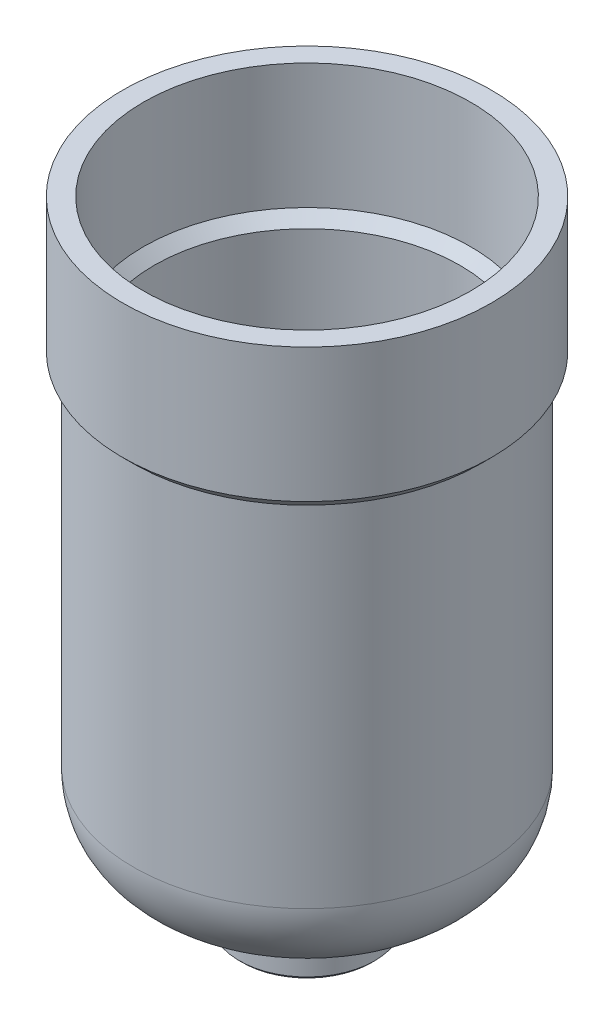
ISO-10303-21;
HEADER;
FILE_DESCRIPTION(('STEP AP214'),'2;1');
FILE_NAME('part.step','',(''),(''),'','','');
FILE_SCHEMA(('AUTOMOTIVE_DESIGN { 1 0 10303 214 1 1 1 1 }'));
ENDSEC;
DATA;
#1=APPLICATION_CONTEXT('core data for automotive mechanical design processes');
#2=APPLICATION_PROTOCOL_DEFINITION('international standard','automotive_design',2000,#1);
#3=PRODUCT_CONTEXT('',#1,'mechanical');
#4=PRODUCT('Part','Part','',(#3));
#5=PRODUCT_RELATED_PRODUCT_CATEGORY('part','',(#4));
#6=PRODUCT_DEFINITION_FORMATION('','',#4);
#7=PRODUCT_DEFINITION_CONTEXT('part definition',#1,'design');
#8=PRODUCT_DEFINITION('design','',#6,#7);
#9=PRODUCT_DEFINITION_SHAPE('','',#8);
#10=(LENGTH_UNIT() NAMED_UNIT(*) SI_UNIT(.MILLI.,.METRE.));
#11=(NAMED_UNIT(*) PLANE_ANGLE_UNIT() SI_UNIT($,.RADIAN.));
#12=(NAMED_UNIT(*) SI_UNIT($,.STERADIAN.) SOLID_ANGLE_UNIT());
#13=UNCERTAINTY_MEASURE_WITH_UNIT(LENGTH_MEASURE(1.E-05),#10,'distance_accuracy_value','');
#14=(GEOMETRIC_REPRESENTATION_CONTEXT(3) GLOBAL_UNCERTAINTY_ASSIGNED_CONTEXT((#13)) GLOBAL_UNIT_ASSIGNED_CONTEXT((#10,
#11,#12)) REPRESENTATION_CONTEXT('',''));
#15=CARTESIAN_POINT('',(0.,0.,0.));
#16=DIRECTION('',(0.,0.,1.));
#17=DIRECTION('',(1.,0.,0.));
#18=AXIS2_PLACEMENT_3D('',#15,#16,#17);
#19=CARTESIAN_POINT('',(-6.7,-53.5,0.));
#20=DIRECTION('',(0.,-1.,0.));
#21=DIRECTION('',(1.,0.,0.));
#22=AXIS2_PLACEMENT_3D('',#19,#20,#21);
#23=PLANE('',#22);
#24=CARTESIAN_POINT('',(0.,-53.5,0.));
#25=DIRECTION('',(0.,-1.,0.));
#26=DIRECTION('',(1.,0.,0.));
#27=AXIS2_PLACEMENT_3D('',#24,#25,#26);
#28=CIRCLE('',#27,6.7);
#29=CARTESIAN_POINT('',(6.7,-53.5,0.));
#30=VERTEX_POINT('',#29);
#31=EDGE_CURVE('E10',#30,#30,#28,.T.);
#32=ORIENTED_EDGE('',*,*,#31,.F.);
#33=EDGE_LOOP('',(#32));
#34=FACE_BOUND('',#33,.T.);
#35=ADVANCED_FACE('F33',(#34),#23,.F.);
#36=CARTESIAN_POINT('',(0.,-45.5,0.));
#37=DIRECTION('',(0.,-1.,0.));
#38=DIRECTION('',(1.,0.,0.));
#39=AXIS2_PLACEMENT_3D('',#36,#37,#38);
#40=DEGENERATE_TOROIDAL_SURFACE('',#39,6.70000000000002,7.99999999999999,.T.);
#41=CARTESIAN_POINT('',(0.,-45.5,0.));
#42=DIRECTION('',(0.,-1.,0.));
#43=DIRECTION('',(1.,0.,0.));
#44=AXIS2_PLACEMENT_3D('',#41,#42,#43);
#45=CIRCLE('',#44,14.7);
#46=CARTESIAN_POINT('',(14.7,-45.5,0.));
#47=VERTEX_POINT('',#46);
#48=EDGE_CURVE('E39',#47,#47,#45,.T.);
#49=ORIENTED_EDGE('',*,*,#48,.F.);
#50=EDGE_LOOP('',(#49));
#51=FACE_BOUND('',#50,.T.);
#52=ORIENTED_EDGE('',*,*,#31,.T.);
#53=EDGE_LOOP('',(#52));
#54=FACE_BOUND('',#53,.T.);
#55=ADVANCED_FACE('F153',(#51,#54),#40,.F.);
#56=CARTESIAN_POINT('',(0.,0.,0.));
#57=DIRECTION('',(0.,-1.,0.));
#58=DIRECTION('',(1.,0.,0.));
#59=AXIS2_PLACEMENT_3D('',#56,#57,#58);
#60=CYLINDRICAL_SURFACE('',#59,14.7);
#61=CARTESIAN_POINT('',(0.,-13.0715728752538,0.));
#62=DIRECTION('',(0.,-1.,0.));
#63=DIRECTION('',(1.,0.,0.));
#64=AXIS2_PLACEMENT_3D('',#61,#62,#63);
#65=CIRCLE('',#64,14.7);
#66=CARTESIAN_POINT('',(14.7,-13.0715728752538,0.));
#67=VERTEX_POINT('',#66);
#68=EDGE_CURVE('E43',#67,#67,#65,.T.);
#69=ORIENTED_EDGE('',*,*,#68,.F.);
#70=EDGE_LOOP('',(#69));
#71=FACE_BOUND('',#70,.T.);
#72=ORIENTED_EDGE('',*,*,#48,.T.);
#73=EDGE_LOOP('',(#72));
#74=FACE_BOUND('',#73,.T.);
#75=ADVANCED_FACE('F148',(#71,#74),#60,.F.);
#76=CARTESIAN_POINT('',(0.,-13.0715728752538,0.));
#77=DIRECTION('',(0.,1.,0.));
#78=DIRECTION('',(-1.,0.,0.));
#79=AXIS2_PLACEMENT_3D('',#76,#77,#78);
#80=CONICAL_SURFACE('',#79,14.7,0.78539816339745);
#81=CARTESIAN_POINT('',(0.,-12.0390728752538,0.));
#82=DIRECTION('',(0.,-1.,0.));
#83=DIRECTION('',(1.,0.,0.));
#84=AXIS2_PLACEMENT_3D('',#81,#82,#83);
#85=CIRCLE('',#84,15.7325);
#86=CARTESIAN_POINT('',(15.7325,-12.0390728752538,0.));
#87=VERTEX_POINT('',#86);
#88=EDGE_CURVE('E47',#87,#87,#85,.T.);
#89=ORIENTED_EDGE('',*,*,#88,.F.);
#90=EDGE_LOOP('',(#89));
#91=FACE_BOUND('',#90,.T.);
#92=ORIENTED_EDGE('',*,*,#68,.T.);
#93=EDGE_LOOP('',(#92));
#94=FACE_BOUND('',#93,.T.);
#95=ADVANCED_FACE('F142',(#91,#94),#80,.F.);
#96=CARTESIAN_POINT('',(0.,0.,0.));
#97=DIRECTION('',(0.,-1.,0.));
#98=DIRECTION('',(1.,0.,0.));
#99=AXIS2_PLACEMENT_3D('',#96,#97,#98);
#100=CYLINDRICAL_SURFACE('',#99,15.7325);
#101=CARTESIAN_POINT('',(0.,0.,0.));
#102=DIRECTION('',(0.,-1.,0.));
#103=DIRECTION('',(1.,0.,0.));
#104=AXIS2_PLACEMENT_3D('',#101,#102,#103);
#105=CIRCLE('',#104,15.7325);
#106=CARTESIAN_POINT('',(15.7325,0.,0.));
#107=VERTEX_POINT('',#106);
#108=EDGE_CURVE('E52',#107,#107,#105,.T.);
#109=ORIENTED_EDGE('',*,*,#108,.F.);
#110=EDGE_LOOP('',(#109));
#111=FACE_BOUND('',#110,.T.);
#112=ORIENTED_EDGE('',*,*,#88,.T.);
#113=EDGE_LOOP('',(#112));
#114=FACE_BOUND('',#113,.T.);
#115=ADVANCED_FACE('F136',(#111,#114),#100,.F.);
#116=CARTESIAN_POINT('',(-17.7325,0.,0.));
#117=DIRECTION('',(0.,-1.,0.));
#118=DIRECTION('',(1.,0.,0.));
#119=AXIS2_PLACEMENT_3D('',#116,#117,#118);
#120=PLANE('',#119);
#121=CARTESIAN_POINT('',(0.,0.,0.));
#122=DIRECTION('',(0.,-1.,0.));
#123=DIRECTION('',(1.,0.,0.));
#124=AXIS2_PLACEMENT_3D('',#121,#122,#123);
#125=CIRCLE('',#124,17.7325);
#126=CARTESIAN_POINT('',(17.7325,0.,0.));
#127=VERTEX_POINT('',#126);
#128=EDGE_CURVE('E55',#127,#127,#125,.T.);
#129=ORIENTED_EDGE('',*,*,#128,.F.);
#130=EDGE_LOOP('',(#129));
#131=FACE_BOUND('',#130,.T.);
#132=ORIENTED_EDGE('',*,*,#108,.T.);
#133=EDGE_LOOP('',(#132));
#134=FACE_BOUND('',#133,.T.);
#135=ADVANCED_FACE('F130',(#131,#134),#120,.F.);
#136=CARTESIAN_POINT('',(0.,0.,0.));
#137=DIRECTION('',(0.,-1.,0.));
#138=DIRECTION('',(1.,0.,0.));
#139=AXIS2_PLACEMENT_3D('',#136,#137,#138);
#140=CYLINDRICAL_SURFACE('',#139,17.7325);
#141=CARTESIAN_POINT('',(0.,-12.8675,0.));
#142=DIRECTION('',(0.,-1.,0.));
#143=DIRECTION('',(1.,0.,0.));
#144=AXIS2_PLACEMENT_3D('',#141,#142,#143);
#145=CIRCLE('',#144,17.7325);
#146=CARTESIAN_POINT('',(17.7325,-12.8675,0.));
#147=VERTEX_POINT('',#146);
#148=EDGE_CURVE('E58',#147,#147,#145,.T.);
#149=ORIENTED_EDGE('',*,*,#148,.F.);
#150=EDGE_LOOP('',(#149));
#151=FACE_BOUND('',#150,.T.);
#152=ORIENTED_EDGE('',*,*,#128,.T.);
#153=EDGE_LOOP('',(#152));
#154=FACE_BOUND('',#153,.T.);
#155=ADVANCED_FACE('F124',(#151,#154),#140,.T.);
#156=CARTESIAN_POINT('',(0.,-12.8675,0.));
#157=DIRECTION('',(0.,1.,0.));
#158=DIRECTION('',(-1.,0.,0.));
#159=AXIS2_PLACEMENT_3D('',#156,#157,#158);
#160=CONICAL_SURFACE('',#159,17.7325,0.78539816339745);
#161=CARTESIAN_POINT('',(0.,-13.9,0.));
#162=DIRECTION('',(0.,-1.,0.));
#163=DIRECTION('',(1.,0.,0.));
#164=AXIS2_PLACEMENT_3D('',#161,#162,#163);
#165=CIRCLE('',#164,16.7);
#166=CARTESIAN_POINT('',(16.7,-13.9,0.));
#167=VERTEX_POINT('',#166);
#168=EDGE_CURVE('E61',#167,#167,#165,.T.);
#169=ORIENTED_EDGE('',*,*,#168,.F.);
#170=EDGE_LOOP('',(#169));
#171=FACE_BOUND('',#170,.T.);
#172=ORIENTED_EDGE('',*,*,#148,.T.);
#173=EDGE_LOOP('',(#172));
#174=FACE_BOUND('',#173,.T.);
#175=ADVANCED_FACE('F118',(#171,#174),#160,.T.);
#176=CARTESIAN_POINT('',(0.,0.,0.));
#177=DIRECTION('',(0.,-1.,0.));
#178=DIRECTION('',(1.,0.,0.));
#179=AXIS2_PLACEMENT_3D('',#176,#177,#178);
#180=CYLINDRICAL_SURFACE('',#179,16.7);
#181=CARTESIAN_POINT('',(0.,-47.5,0.));
#182=DIRECTION('',(0.,-1.,0.));
#183=DIRECTION('',(1.,0.,0.));
#184=AXIS2_PLACEMENT_3D('',#181,#182,#183);
#185=CIRCLE('',#184,16.7);
#186=CARTESIAN_POINT('',(16.7,-47.5,0.));
#187=VERTEX_POINT('',#186);
#188=EDGE_CURVE('E64',#187,#187,#185,.T.);
#189=ORIENTED_EDGE('',*,*,#188,.F.);
#190=EDGE_LOOP('',(#189));
#191=FACE_BOUND('',#190,.T.);
#192=ORIENTED_EDGE('',*,*,#168,.T.);
#193=EDGE_LOOP('',(#192));
#194=FACE_BOUND('',#193,.T.);
#195=ADVANCED_FACE('F112',(#191,#194),#180,.T.);
#196=CARTESIAN_POINT('',(0.,-47.5,0.));
#197=DIRECTION('',(0.,-1.,0.));
#198=DIRECTION('',(1.,0.,0.));
#199=AXIS2_PLACEMENT_3D('',#196,#197,#198);
#200=TOROIDAL_SURFACE('',#199,8.7,7.99999999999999);
#201=CARTESIAN_POINT('',(0.,-55.5,0.));
#202=DIRECTION('',(0.,-1.,0.));
#203=DIRECTION('',(1.,0.,0.));
#204=AXIS2_PLACEMENT_3D('',#201,#202,#203);
#205=CIRCLE('',#204,8.7);
#206=CARTESIAN_POINT('',(8.7,-55.5,0.));
#207=VERTEX_POINT('',#206);
#208=EDGE_CURVE('E67',#207,#207,#205,.T.);
#209=ORIENTED_EDGE('',*,*,#208,.F.);
#210=EDGE_LOOP('',(#209));
#211=FACE_BOUND('',#210,.T.);
#212=ORIENTED_EDGE('',*,*,#188,.T.);
#213=EDGE_LOOP('',(#212));
#214=FACE_BOUND('',#213,.T.);
#215=ADVANCED_FACE('F106',(#211,#214),#200,.T.);
#216=CARTESIAN_POINT('',(-7.5,-55.5,0.));
#217=DIRECTION('',(0.,1.,0.));
#218=DIRECTION('',(-1.,0.,0.));
#219=AXIS2_PLACEMENT_3D('',#216,#217,#218);
#220=PLANE('',#219);
#221=CARTESIAN_POINT('',(0.,-55.5,0.));
#222=DIRECTION('',(0.,-1.,0.));
#223=DIRECTION('',(1.,0.,0.));
#224=AXIS2_PLACEMENT_3D('',#221,#222,#223);
#225=CIRCLE('',#224,7.5);
#226=CARTESIAN_POINT('',(7.5,-55.5,0.));
#227=VERTEX_POINT('',#226);
#228=EDGE_CURVE('E70',#227,#227,#225,.T.);
#229=ORIENTED_EDGE('',*,*,#228,.F.);
#230=EDGE_LOOP('',(#229));
#231=FACE_BOUND('',#230,.T.);
#232=ORIENTED_EDGE('',*,*,#208,.T.);
#233=EDGE_LOOP('',(#232));
#234=FACE_BOUND('',#233,.T.);
#235=ADVANCED_FACE('F100',(#231,#234),#220,.F.);
#236=CARTESIAN_POINT('',(0.,-56.5,0.));
#237=DIRECTION('',(0.,-1.,0.));
#238=DIRECTION('',(1.,0.,0.));
#239=AXIS2_PLACEMENT_3D('',#236,#237,#238);
#240=TOROIDAL_SURFACE('',#239,7.50000000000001,1.);
#241=CARTESIAN_POINT('',(0.,-56.5,0.));
#242=DIRECTION('',(0.,-1.,0.));
#243=DIRECTION('',(1.,0.,0.));
#244=AXIS2_PLACEMENT_3D('',#241,#242,#243);
#245=CIRCLE('',#244,6.5);
#246=CARTESIAN_POINT('',(6.5,-56.5,0.));
#247=VERTEX_POINT('',#246);
#248=EDGE_CURVE('E73',#247,#247,#245,.T.);
#249=ORIENTED_EDGE('',*,*,#248,.F.);
#250=EDGE_LOOP('',(#249));
#251=FACE_BOUND('',#250,.T.);
#252=ORIENTED_EDGE('',*,*,#228,.T.);
#253=EDGE_LOOP('',(#252));
#254=FACE_BOUND('',#253,.T.);
#255=ADVANCED_FACE('F94',(#251,#254),#240,.F.);
#256=CARTESIAN_POINT('',(0.,0.,0.));
#257=DIRECTION('',(0.,-1.,0.));
#258=DIRECTION('',(1.,0.,0.));
#259=AXIS2_PLACEMENT_3D('',#256,#257,#258);
#260=CYLINDRICAL_SURFACE('',#259,6.5);
#261=CARTESIAN_POINT('',(0.,-60.4,0.));
#262=DIRECTION('',(0.,-1.,0.));
#263=DIRECTION('',(1.,0.,0.));
#264=AXIS2_PLACEMENT_3D('',#261,#262,#263);
#265=CIRCLE('',#264,6.5);
#266=CARTESIAN_POINT('',(6.5,-60.4,0.));
#267=VERTEX_POINT('',#266);
#268=EDGE_CURVE('E76',#267,#267,#265,.T.);
#269=ORIENTED_EDGE('',*,*,#268,.F.);
#270=EDGE_LOOP('',(#269));
#271=FACE_BOUND('',#270,.T.);
#272=ORIENTED_EDGE('',*,*,#248,.T.);
#273=EDGE_LOOP('',(#272));
#274=FACE_BOUND('',#273,.T.);
#275=ADVANCED_FACE('F88',(#271,#274),#260,.T.);
#276=CARTESIAN_POINT('',(0.,-60.4,0.));
#277=DIRECTION('',(0.,1.,0.));
#278=DIRECTION('',(-1.,0.,0.));
#279=AXIS2_PLACEMENT_3D('',#276,#277,#278);
#280=CONICAL_SURFACE('',#279,6.5,0.785398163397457);
#281=CARTESIAN_POINT('',(0.,-60.7,0.));
#282=DIRECTION('',(0.,-1.,0.));
#283=DIRECTION('',(1.,0.,0.));
#284=AXIS2_PLACEMENT_3D('',#281,#282,#283);
#285=CIRCLE('',#284,6.2);
#286=CARTESIAN_POINT('',(6.2,-60.7,0.));
#287=VERTEX_POINT('',#286);
#288=EDGE_CURVE('E79',#287,#287,#285,.T.);
#289=ORIENTED_EDGE('',*,*,#288,.F.);
#290=EDGE_LOOP('',(#289));
#291=FACE_BOUND('',#290,.T.);
#292=ORIENTED_EDGE('',*,*,#268,.T.);
#293=EDGE_LOOP('',(#292));
#294=FACE_BOUND('',#293,.T.);
#295=ADVANCED_FACE('F85',(#291,#294),#280,.T.);
#296=CARTESIAN_POINT('',(0.,-60.7,0.));
#297=DIRECTION('',(0.,1.,0.));
#298=DIRECTION('',(-1.,0.,0.));
#299=AXIS2_PLACEMENT_3D('',#296,#297,#298);
#300=PLANE('',#299);
#301=ORIENTED_EDGE('',*,*,#288,.T.);
#302=EDGE_LOOP('',(#301));
#303=FACE_BOUND('',#302,.T.);
#304=ADVANCED_FACE('F83',(#303),#300,.F.);
#305=CLOSED_SHELL('',(#35,#55,#75,#95,#115,#135,#155,#175,#195,#215,#235,#255,#275,#295,#304));
#306=MANIFOLD_SOLID_BREP('B2',#305);
#307=ADVANCED_BREP_SHAPE_REPRESENTATION('',(#18,#306),#14);
#308=SHAPE_DEFINITION_REPRESENTATION(#9,#307);
ENDSEC;
END-ISO-10303-21;
